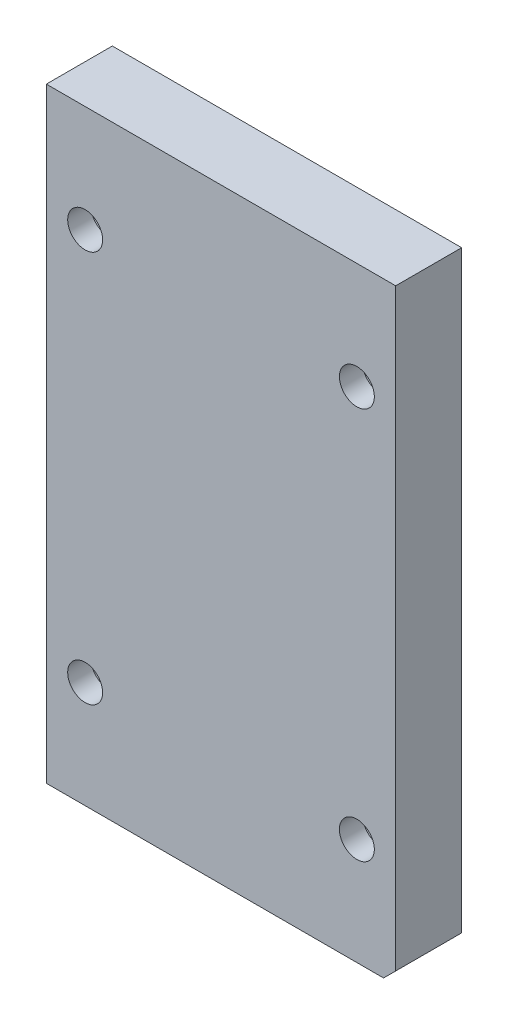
from build123d import *

# Parameters (mm, degrees)
SKETCH1_W                = 90
SKETCH1_H                = 156
BOSS_EXTRUDE1_DEPTH      = 17
HOLE1_D                  = 9
HOLE1_CBORE_D            = 15
HOLE1_CBORE_DEPTH        = 11
TAPPED_HOLE1_D           = 3.3
TAPPED_HOLE1_DEPTH       = 11.008579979
TAPPED_HOLE1_CBORE_D     = 4
TAPPED_HOLE1_CBORE_DEPTH = 7
TAPPED_HOLE1_TIP         = 0.991420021
CHAMFER1_SIZE            = 3.12


with BuildPart() as part:
    # Sketch1 → Boss-Extrude1 (new body)
    with BuildSketch(Plane.XY):
        Rectangle(SKETCH1_W, SKETCH1_H)
    extrude(amount=-BOSS_EXTRUDE1_DEPTH)

    # Hole1 (through all)
    with Locations(Plane(origin=(0, 0, -17), x_dir=(1, 0, 0), z_dir=(0, 0, -1))):
        with Locations((35, -50.5), (35, 50.5), (-35, 50.5), (-35, -50.5)):
            CounterBoreHole(HOLE1_D / 2, HOLE1_CBORE_D / 2, HOLE1_CBORE_DEPTH)

    # Tapped Hole1
    with Locations(Plane(origin=(522.991452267, 0, -17), x_dir=(-1, 0, 0), z_dir=(0, 0, -1))):
        with Locations((487.991452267, 68), (487.991452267, -68), (557.991452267, -68), (557.991452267, 68)):
            CounterBoreHole(TAPPED_HOLE1_D / 2, TAPPED_HOLE1_CBORE_D / 2, TAPPED_HOLE1_CBORE_DEPTH, depth=TAPPED_HOLE1_DEPTH)
            with Locations((0, 0, -(TAPPED_HOLE1_DEPTH + TAPPED_HOLE1_TIP / 2))):  # 118° drill point
                Cone(0, TAPPED_HOLE1_D / 2, TAPPED_HOLE1_TIP, mode=Mode.SUBTRACT)

    # Chamfer1
    chamfer1_edges = [part.edges().sort_by_distance(p)[0] for p in [
        (45, -78, -8.5),
    ]]
    chamfer(chamfer1_edges, length=CHAMFER1_SIZE)


solid = part.part
